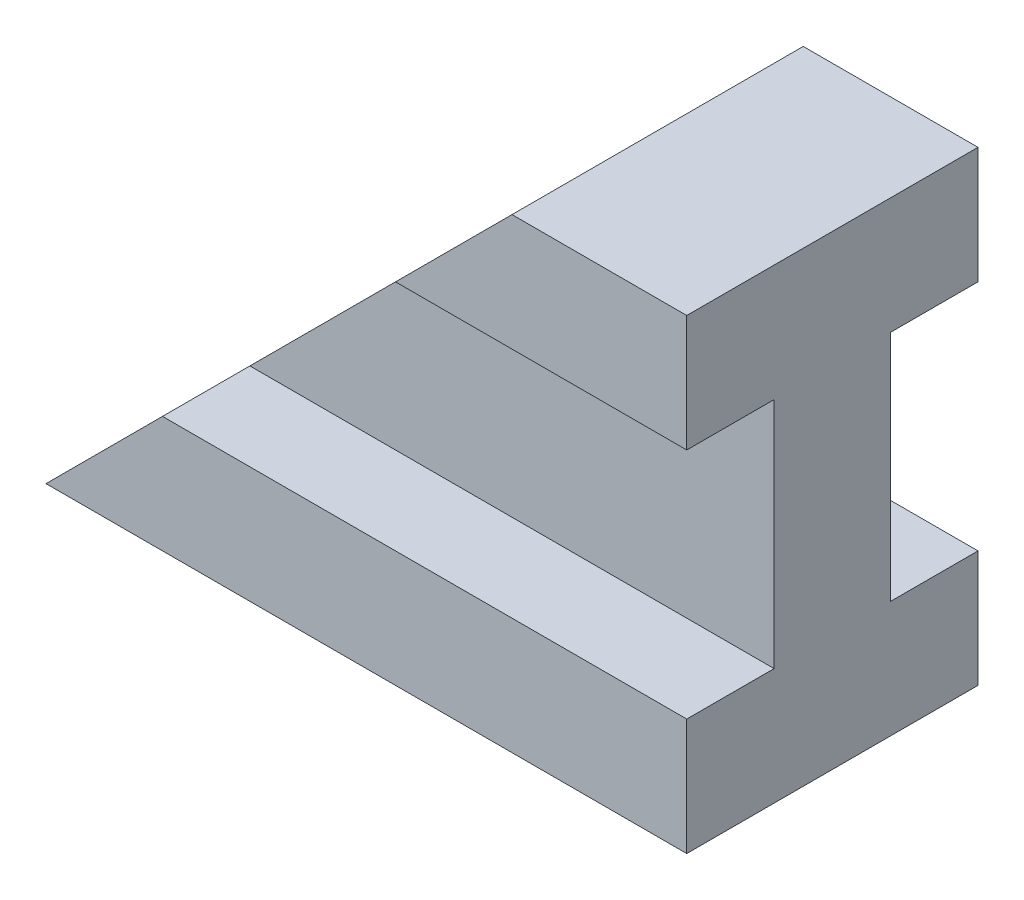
from build123d import *

# Parameters (mm, degrees)
EXTRUDE_1_DEPTH     = 50
SKETCH_2_W          = 15
SKETCH_2_H          = 40
CUT_EXTRUDE_1_DEPTH = 145.913767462


with BuildPart() as part:
    # Sketch 1 → Extrude 1 (new body)
    with BuildSketch(Plane.XY):
        Polygon((0, 0), (110, 0), (110, 80), (80, 80), align=None)
    extrude(amount=EXTRUDE_1_DEPTH)

    # Sketch 2 → Cut-Extrude 1 (cut, through all)
    with BuildSketch(Plane(origin=(110, 0, 0), x_dir=(0, 0, -1), z_dir=(1, 0, 0))):
        with Locations((-42.5, 40)):
            Rectangle(SKETCH_2_W, SKETCH_2_H)
        with Locations((-7.5, 40)):
            Rectangle(SKETCH_2_W, SKETCH_2_H)
    extrude(amount=-CUT_EXTRUDE_1_DEPTH, mode=Mode.SUBTRACT)


solid = part.part
